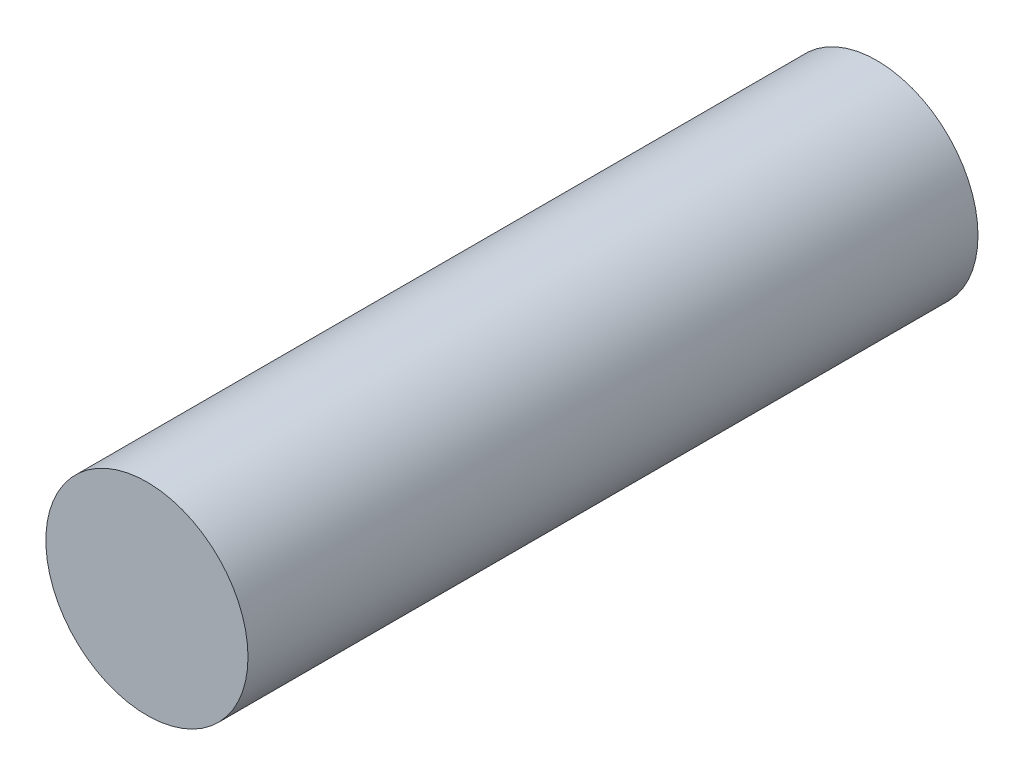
from build123d import *

# Parameters (mm, degrees)
SKETCH1_R           = 9
BOSS_EXTRUDE1_DEPTH = 65


with BuildPart() as part:
    # Sketch1 → Boss-Extrude1 (new body)
    with BuildSketch(Plane.XY):
        Circle(SKETCH1_R)
    extrude(amount=-BOSS_EXTRUDE1_DEPTH)


solid = part.part
